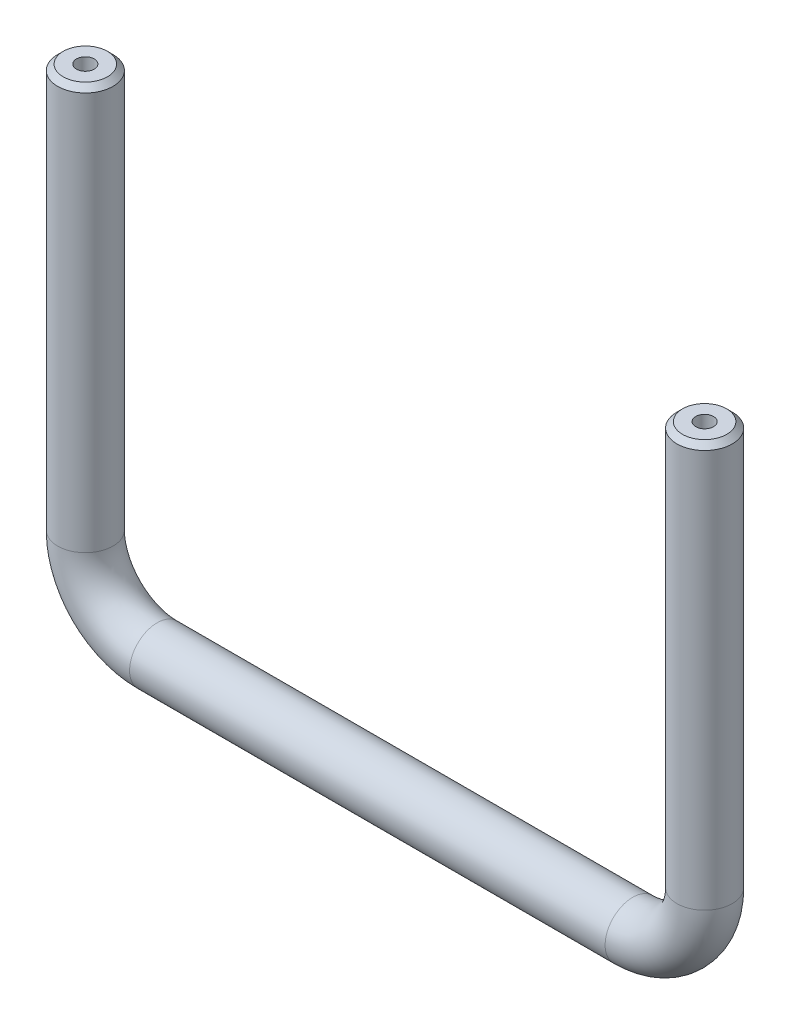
from build123d import *

# Parameters (mm, degrees)
SKETCH2_R                   = 7.9375
CHAMFER1_SIZE               = 1.5875
F_1_4_20_TAPPED_HOLE1_D     = 5.1054
F_1_4_20_TAPPED_HOLE1_DEPTH = 25.4
F_1_4_20_TAPPED_HOLE1_TIP   = 1.533816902


with BuildPart() as part:
    # Sweep1: sweep along a path in Sketch1
    with BuildLine(Plane.XY) as sweep1_path:
        Line((-88.9, 136.525), (-88.9, 20.6375))
        ThreePointArc((-88.9, 20.6375), (-82.855416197, 6.044583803), (-68.2625, 0))
        Line((-68.2625, 0), (68.2625, 0))
        ThreePointArc((68.2625, 0), (82.855416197, 6.044583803), (88.9, 20.6375))
        Line((88.9, 20.6375), (88.9, 136.525))
    # Sketch2 → Sweep1 (sweep)
    with BuildSketch(Plane(origin=(-88.9, 136.525, 0), x_dir=(-1, 0, 0), z_dir=(0, -1, 0))):
        Circle(SKETCH2_R)
    sweep(path=sweep1_path.line)

    # Chamfer1
    chamfer1_edges = [part.edges().sort_by_distance(p)[0] for p in [
        (-80.9625, 136.525, 0),
        (80.9625, 136.525, 0),
    ]]
    chamfer(chamfer1_edges, length=CHAMFER1_SIZE)

    # 1_4-20 Tapped Hole1
    with Locations(Plane(origin=(0, 136.525, 0), x_dir=(1, 0, 0), z_dir=(0, 1, 0))):
        with Locations((-88.9, 0), (88.9, 0)):
            Hole(F_1_4_20_TAPPED_HOLE1_D / 2, depth=F_1_4_20_TAPPED_HOLE1_DEPTH)
            with Locations((0, 0, -(F_1_4_20_TAPPED_HOLE1_DEPTH + F_1_4_20_TAPPED_HOLE1_TIP / 2))):  # 118° drill point
                Cone(0, F_1_4_20_TAPPED_HOLE1_D / 2, F_1_4_20_TAPPED_HOLE1_TIP, mode=Mode.SUBTRACT)


solid = part.part
